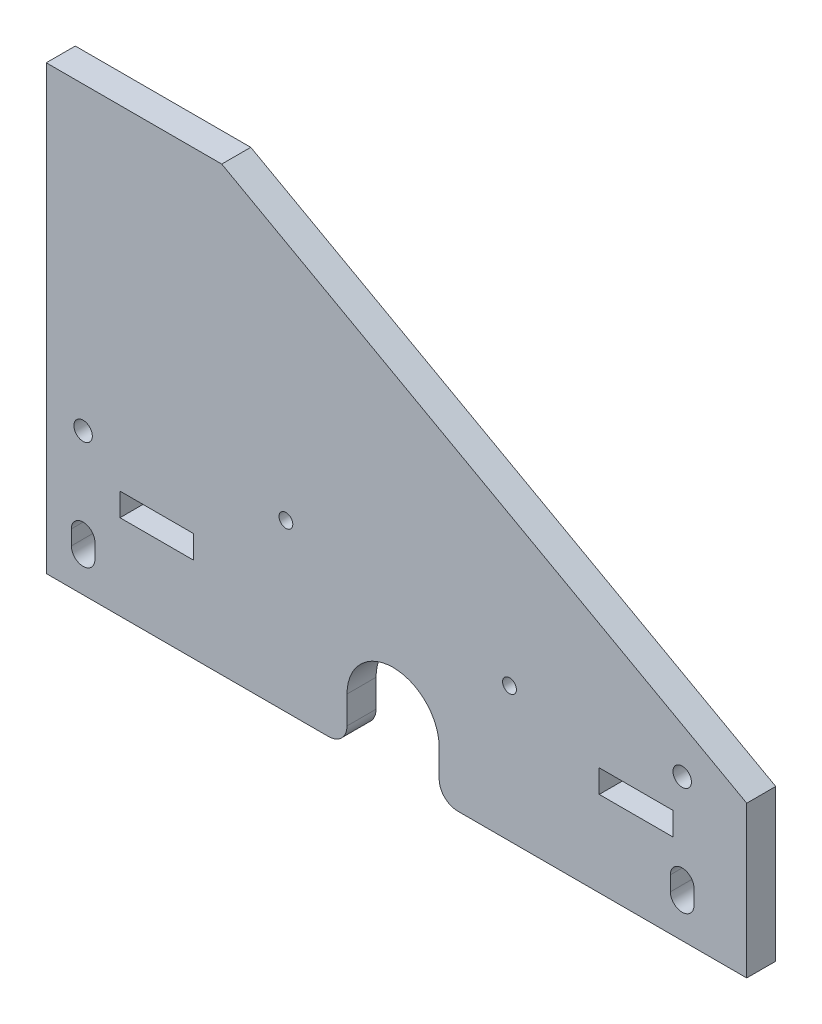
ISO-10303-21;
HEADER;
FILE_DESCRIPTION(('STEP AP214'),'2;1');
FILE_NAME('part.step','',(''),(''),'','','');
FILE_SCHEMA(('AUTOMOTIVE_DESIGN { 1 0 10303 214 1 1 1 1 }'));
ENDSEC;
DATA;
#1=APPLICATION_CONTEXT('core data for automotive mechanical design processes');
#2=APPLICATION_PROTOCOL_DEFINITION('international standard','automotive_design',2000,#1);
#3=PRODUCT_CONTEXT('',#1,'mechanical');
#4=PRODUCT('Part','Part','',(#3));
#5=PRODUCT_RELATED_PRODUCT_CATEGORY('part','',(#4));
#6=PRODUCT_DEFINITION_FORMATION('','',#4);
#7=PRODUCT_DEFINITION_CONTEXT('part definition',#1,'design');
#8=PRODUCT_DEFINITION('design','',#6,#7);
#9=PRODUCT_DEFINITION_SHAPE('','',#8);
#10=(LENGTH_UNIT() NAMED_UNIT(*) SI_UNIT(.MILLI.,.METRE.));
#11=(NAMED_UNIT(*) PLANE_ANGLE_UNIT() SI_UNIT($,.RADIAN.));
#12=(NAMED_UNIT(*) SI_UNIT($,.STERADIAN.) SOLID_ANGLE_UNIT());
#13=UNCERTAINTY_MEASURE_WITH_UNIT(LENGTH_MEASURE(1.E-05),#10,'distance_accuracy_value','');
#14=(GEOMETRIC_REPRESENTATION_CONTEXT(3) GLOBAL_UNCERTAINTY_ASSIGNED_CONTEXT((#13)) GLOBAL_UNIT_ASSIGNED_CONTEXT((#10,
#11,#12)) REPRESENTATION_CONTEXT('',''));
#15=CARTESIAN_POINT('',(0.,0.,0.));
#16=DIRECTION('',(0.,0.,1.));
#17=DIRECTION('',(1.,0.,0.));
#18=AXIS2_PLACEMENT_3D('',#15,#16,#17);
#19=CARTESIAN_POINT('',(-60.6694920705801,-18.231916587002,0.));
#20=DIRECTION('',(0.,0.,1.));
#21=DIRECTION('',(1.,0.,0.));
#22=AXIS2_PLACEMENT_3D('',#19,#20,#21);
#23=CYLINDRICAL_SURFACE('',#22,6.35);
#24=CARTESIAN_POINT('',(-60.6694920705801,-18.231916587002,10.));
#25=DIRECTION('',(0.,0.,1.));
#26=DIRECTION('',(1.,0.,0.));
#27=AXIS2_PLACEMENT_3D('',#24,#25,#26);
#28=CIRCLE('',#27,6.35);
#29=CARTESIAN_POINT('',(-67.0194920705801,-18.231916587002,10.));
#30=VERTEX_POINT('',#29);
#31=CARTESIAN_POINT('',(-60.6694920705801,-24.581916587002,10.));
#32=VERTEX_POINT('',#31);
#33=EDGE_CURVE('E364',#30,#32,#28,.T.);
#34=ORIENTED_EDGE('',*,*,#33,.F.);
#35=DIRECTION('',(0.,0.,1.));
#36=VECTOR('',#35,1.);
#37=CARTESIAN_POINT('',(-67.0194920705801,-18.231916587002,0.));
#38=LINE('',#37,#36);
#39=CARTESIAN_POINT('',(-67.0194920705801,-18.231916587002,0.));
#40=VERTEX_POINT('',#39);
#41=EDGE_CURVE('E11',#40,#30,#38,.T.);
#42=ORIENTED_EDGE('',*,*,#41,.F.);
#43=CARTESIAN_POINT('',(-60.6694920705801,-18.231916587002,0.));
#44=DIRECTION('',(0.,0.,1.));
#45=DIRECTION('',(1.,0.,0.));
#46=AXIS2_PLACEMENT_3D('',#43,#44,#45);
#47=CIRCLE('',#46,6.35);
#48=CARTESIAN_POINT('',(-60.6694920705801,-24.581916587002,0.));
#49=VERTEX_POINT('',#48);
#50=EDGE_CURVE('E367',#40,#49,#47,.T.);
#51=ORIENTED_EDGE('',*,*,#50,.T.);
#52=DIRECTION('',(0.,0.,1.));
#53=VECTOR('',#52,1.);
#54=CARTESIAN_POINT('',(-60.6694920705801,-24.581916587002,0.));
#55=LINE('',#54,#53);
#56=EDGE_CURVE('E34',#49,#32,#55,.T.);
#57=ORIENTED_EDGE('',*,*,#56,.T.);
#58=EDGE_LOOP('',(#34,#42,#51,#57));
#59=FACE_BOUND('',#58,.T.);
#60=ADVANCED_FACE('F31',(#59),#23,.T.);
#61=CARTESIAN_POINT('',(-67.0194920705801,-8.70691658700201,0.));
#62=DIRECTION('',(-1.,0.,0.));
#63=DIRECTION('',(0.,0.,1.));
#64=AXIS2_PLACEMENT_3D('',#61,#62,#63);
#65=PLANE('',#64);
#66=DIRECTION('',(0.,-1.,0.));
#67=VECTOR('',#66,1.);
#68=CARTESIAN_POINT('',(-67.0194920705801,-8.70691658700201,10.));
#69=LINE('',#68,#67);
#70=CARTESIAN_POINT('',(-67.0194920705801,-8.70691658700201,10.));
#71=VERTEX_POINT('',#70);
#72=EDGE_CURVE('E371',#71,#30,#69,.T.);
#73=ORIENTED_EDGE('',*,*,#72,.F.);
#74=DIRECTION('',(0.,0.,1.));
#75=VECTOR('',#74,1.);
#76=CARTESIAN_POINT('',(-67.0194920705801,-8.70691658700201,0.));
#77=LINE('',#76,#75);
#78=CARTESIAN_POINT('',(-67.0194920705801,-8.70691658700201,0.));
#79=VERTEX_POINT('',#78);
#80=EDGE_CURVE('E39',#79,#71,#77,.T.);
#81=ORIENTED_EDGE('',*,*,#80,.F.);
#82=DIRECTION('',(0.,-1.,0.));
#83=VECTOR('',#82,1.);
#84=CARTESIAN_POINT('',(-67.0194920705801,-8.70691658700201,0.));
#85=LINE('',#84,#83);
#86=EDGE_CURVE('E398',#79,#40,#85,.T.);
#87=ORIENTED_EDGE('',*,*,#86,.T.);
#88=ORIENTED_EDGE('',*,*,#41,.T.);
#89=EDGE_LOOP('',(#73,#81,#87,#88));
#90=FACE_BOUND('',#89,.T.);
#91=ADVANCED_FACE('F460',(#90),#65,.T.);
#92=CARTESIAN_POINT('',(-82.8944920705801,-8.70691658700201,0.));
#93=DIRECTION('',(0.,0.,1.));
#94=DIRECTION('',(1.,0.,0.));
#95=AXIS2_PLACEMENT_3D('',#92,#93,#94);
#96=CYLINDRICAL_SURFACE('',#95,15.875);
#97=CARTESIAN_POINT('',(-82.8944920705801,-8.70691658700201,10.));
#98=DIRECTION('',(0.,0.,-1.));
#99=DIRECTION('',(-1.,0.,0.));
#100=AXIS2_PLACEMENT_3D('',#97,#98,#99);
#101=CIRCLE('',#100,15.875);
#102=CARTESIAN_POINT('',(-98.7694920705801,-8.70691658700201,10.));
#103=VERTEX_POINT('',#102);
#104=EDGE_CURVE('E427',#103,#71,#101,.T.);
#105=ORIENTED_EDGE('',*,*,#104,.F.);
#106=DIRECTION('',(0.,0.,1.));
#107=VECTOR('',#106,1.);
#108=CARTESIAN_POINT('',(-98.7694920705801,-8.70691658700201,0.));
#109=LINE('',#108,#107);
#110=CARTESIAN_POINT('',(-98.7694920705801,-8.70691658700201,0.));
#111=VERTEX_POINT('',#110);
#112=EDGE_CURVE('E433',#111,#103,#109,.T.);
#113=ORIENTED_EDGE('',*,*,#112,.F.);
#114=CARTESIAN_POINT('',(-82.8944920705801,-8.70691658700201,0.));
#115=DIRECTION('',(0.,0.,-1.));
#116=DIRECTION('',(-1.,0.,0.));
#117=AXIS2_PLACEMENT_3D('',#114,#115,#116);
#118=CIRCLE('',#117,15.875);
#119=EDGE_CURVE('E395',#111,#79,#118,.T.);
#120=ORIENTED_EDGE('',*,*,#119,.T.);
#121=ORIENTED_EDGE('',*,*,#80,.T.);
#122=EDGE_LOOP('',(#105,#113,#120,#121));
#123=FACE_BOUND('',#122,.T.);
#124=ADVANCED_FACE('F492',(#123),#96,.F.);
#125=CARTESIAN_POINT('',(-98.7694920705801,-18.231916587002,0.));
#126=DIRECTION('',(1.,0.,0.));
#127=DIRECTION('',(0.,0.,-1.));
#128=AXIS2_PLACEMENT_3D('',#125,#126,#127);
#129=PLANE('',#128);
#130=DIRECTION('',(0.,1.,0.));
#131=VECTOR('',#130,1.);
#132=CARTESIAN_POINT('',(-98.7694920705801,-18.231916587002,10.));
#133=LINE('',#132,#131);
#134=CARTESIAN_POINT('',(-98.7694920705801,-18.231916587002,10.));
#135=VERTEX_POINT('',#134);
#136=EDGE_CURVE('E424',#135,#103,#133,.T.);
#137=ORIENTED_EDGE('',*,*,#136,.F.);
#138=DIRECTION('',(0.,0.,1.));
#139=VECTOR('',#138,1.);
#140=CARTESIAN_POINT('',(-98.7694920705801,-18.231916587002,0.));
#141=LINE('',#140,#139);
#142=CARTESIAN_POINT('',(-98.7694920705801,-18.231916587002,0.));
#143=VERTEX_POINT('',#142);
#144=EDGE_CURVE('E435',#143,#135,#141,.T.);
#145=ORIENTED_EDGE('',*,*,#144,.F.);
#146=DIRECTION('',(0.,1.,0.));
#147=VECTOR('',#146,1.);
#148=CARTESIAN_POINT('',(-98.7694920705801,-18.231916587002,0.));
#149=LINE('',#148,#147);
#150=EDGE_CURVE('E392',#143,#111,#149,.T.);
#151=ORIENTED_EDGE('',*,*,#150,.T.);
#152=ORIENTED_EDGE('',*,*,#112,.T.);
#153=EDGE_LOOP('',(#137,#145,#151,#152));
#154=FACE_BOUND('',#153,.T.);
#155=ADVANCED_FACE('F490',(#154),#129,.T.);
#156=CARTESIAN_POINT('',(-105.11949207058,-18.231916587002,0.));
#157=DIRECTION('',(0.,0.,1.));
#158=DIRECTION('',(1.,0.,0.));
#159=AXIS2_PLACEMENT_3D('',#156,#157,#158);
#160=CYLINDRICAL_SURFACE('',#159,6.34999999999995);
#161=CARTESIAN_POINT('',(-105.11949207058,-18.231916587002,10.));
#162=DIRECTION('',(0.,0.,1.));
#163=DIRECTION('',(1.,0.,0.));
#164=AXIS2_PLACEMENT_3D('',#161,#162,#163);
#165=CIRCLE('',#164,6.34999999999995);
#166=CARTESIAN_POINT('',(-105.11949207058,-24.5819165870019,10.));
#167=VERTEX_POINT('',#166);
#168=EDGE_CURVE('E421',#167,#135,#165,.T.);
#169=ORIENTED_EDGE('',*,*,#168,.F.);
#170=DIRECTION('',(0.,0.,1.));
#171=VECTOR('',#170,1.);
#172=CARTESIAN_POINT('',(-105.11949207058,-24.5819165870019,0.));
#173=LINE('',#172,#171);
#174=CARTESIAN_POINT('',(-105.11949207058,-24.5819165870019,0.));
#175=VERTEX_POINT('',#174);
#176=EDGE_CURVE('E437',#175,#167,#173,.T.);
#177=ORIENTED_EDGE('',*,*,#176,.F.);
#178=CARTESIAN_POINT('',(-105.11949207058,-18.231916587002,0.));
#179=DIRECTION('',(0.,0.,1.));
#180=DIRECTION('',(1.,0.,0.));
#181=AXIS2_PLACEMENT_3D('',#178,#179,#180);
#182=CIRCLE('',#181,6.34999999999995);
#183=EDGE_CURVE('E389',#175,#143,#182,.T.);
#184=ORIENTED_EDGE('',*,*,#183,.T.);
#185=ORIENTED_EDGE('',*,*,#144,.T.);
#186=EDGE_LOOP('',(#169,#177,#184,#185));
#187=FACE_BOUND('',#186,.T.);
#188=ADVANCED_FACE('F486',(#187),#160,.T.);
#189=CARTESIAN_POINT('',(-202.37863207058,-24.581916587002,0.));
#190=DIRECTION('',(0.,-1.,0.));
#191=DIRECTION('',(0.,0.,-1.));
#192=AXIS2_PLACEMENT_3D('',#189,#190,#191);
#193=PLANE('',#192);
#194=DIRECTION('',(1.,0.,0.));
#195=VECTOR('',#194,1.);
#196=CARTESIAN_POINT('',(-202.37863207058,-24.581916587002,10.));
#197=LINE('',#196,#195);
#198=CARTESIAN_POINT('',(-202.37863207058,-24.581916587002,10.));
#199=VERTEX_POINT('',#198);
#200=EDGE_CURVE('E418',#199,#167,#197,.T.);
#201=ORIENTED_EDGE('',*,*,#200,.F.);
#202=DIRECTION('',(0.,0.,1.));
#203=VECTOR('',#202,1.);
#204=CARTESIAN_POINT('',(-202.37863207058,-24.581916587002,0.));
#205=LINE('',#204,#203);
#206=CARTESIAN_POINT('',(-202.37863207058,-24.581916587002,0.));
#207=VERTEX_POINT('',#206);
#208=EDGE_CURVE('E439',#207,#199,#205,.T.);
#209=ORIENTED_EDGE('',*,*,#208,.F.);
#210=DIRECTION('',(1.,0.,0.));
#211=VECTOR('',#210,1.);
#212=CARTESIAN_POINT('',(-202.37863207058,-24.581916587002,0.));
#213=LINE('',#212,#211);
#214=EDGE_CURVE('E386',#207,#175,#213,.T.);
#215=ORIENTED_EDGE('',*,*,#214,.T.);
#216=ORIENTED_EDGE('',*,*,#176,.T.);
#217=EDGE_LOOP('',(#201,#209,#215,#216));
#218=FACE_BOUND('',#217,.T.);
#219=ADVANCED_FACE('F482',(#218),#193,.T.);
#220=CARTESIAN_POINT('',(-202.37863207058,127.818083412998,0.));
#221=DIRECTION('',(-1.,0.,0.));
#222=DIRECTION('',(0.,0.,1.));
#223=AXIS2_PLACEMENT_3D('',#220,#221,#222);
#224=PLANE('',#223);
#225=DIRECTION('',(0.,-1.,0.));
#226=VECTOR('',#225,1.);
#227=CARTESIAN_POINT('',(-202.37863207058,127.818083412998,10.));
#228=LINE('',#227,#226);
#229=CARTESIAN_POINT('',(-202.37863207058,127.818083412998,10.));
#230=VERTEX_POINT('',#229);
#231=EDGE_CURVE('E415',#230,#199,#228,.T.);
#232=ORIENTED_EDGE('',*,*,#231,.F.);
#233=DIRECTION('',(0.,0.,1.));
#234=VECTOR('',#233,1.);
#235=CARTESIAN_POINT('',(-202.37863207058,127.818083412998,0.));
#236=LINE('',#235,#234);
#237=CARTESIAN_POINT('',(-202.37863207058,127.818083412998,0.));
#238=VERTEX_POINT('',#237);
#239=EDGE_CURVE('E441',#238,#230,#236,.T.);
#240=ORIENTED_EDGE('',*,*,#239,.F.);
#241=DIRECTION('',(0.,-1.,0.));
#242=VECTOR('',#241,1.);
#243=CARTESIAN_POINT('',(-202.37863207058,127.818083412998,0.));
#244=LINE('',#243,#242);
#245=EDGE_CURVE('E383',#238,#207,#244,.T.);
#246=ORIENTED_EDGE('',*,*,#245,.T.);
#247=ORIENTED_EDGE('',*,*,#208,.T.);
#248=EDGE_LOOP('',(#232,#240,#246,#247));
#249=FACE_BOUND('',#248,.T.);
#250=ADVANCED_FACE('F478',(#249),#224,.T.);
#251=CARTESIAN_POINT('',(-141.92663207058,127.818083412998,0.));
#252=DIRECTION('',(0.,1.,0.));
#253=DIRECTION('',(0.,0.,1.));
#254=AXIS2_PLACEMENT_3D('',#251,#252,#253);
#255=PLANE('',#254);
#256=DIRECTION('',(-1.,0.,0.));
#257=VECTOR('',#256,1.);
#258=CARTESIAN_POINT('',(-141.92663207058,127.818083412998,10.));
#259=LINE('',#258,#257);
#260=CARTESIAN_POINT('',(-141.92663207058,127.818083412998,10.));
#261=VERTEX_POINT('',#260);
#262=EDGE_CURVE('E412',#261,#230,#259,.T.);
#263=ORIENTED_EDGE('',*,*,#262,.F.);
#264=DIRECTION('',(0.,0.,1.));
#265=VECTOR('',#264,1.);
#266=CARTESIAN_POINT('',(-141.92663207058,127.818083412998,0.));
#267=LINE('',#266,#265);
#268=CARTESIAN_POINT('',(-141.92663207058,127.818083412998,0.));
#269=VERTEX_POINT('',#268);
#270=EDGE_CURVE('E443',#269,#261,#267,.T.);
#271=ORIENTED_EDGE('',*,*,#270,.F.);
#272=DIRECTION('',(-1.,0.,0.));
#273=VECTOR('',#272,1.);
#274=CARTESIAN_POINT('',(-141.92663207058,127.818083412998,0.));
#275=LINE('',#274,#273);
#276=EDGE_CURVE('E380',#269,#238,#275,.T.);
#277=ORIENTED_EDGE('',*,*,#276,.T.);
#278=ORIENTED_EDGE('',*,*,#239,.T.);
#279=EDGE_LOOP('',(#263,#271,#277,#278));
#280=FACE_BOUND('',#279,.T.);
#281=ADVANCED_FACE('F474',(#280),#255,.T.);
#282=CARTESIAN_POINT('',(38.92136792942,27.5724000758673,0.));
#283=DIRECTION('',(0.484809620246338,0.874619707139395,0.));
#284=DIRECTION('',(-0.874619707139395,0.484809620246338,0.));
#285=AXIS2_PLACEMENT_3D('',#282,#283,#284);
#286=PLANE('',#285);
#287=DIRECTION('',(-0.874619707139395,0.484809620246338,0.));
#288=VECTOR('',#287,1.);
#289=CARTESIAN_POINT('',(38.92136792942,27.5724000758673,10.));
#290=LINE('',#289,#288);
#291=CARTESIAN_POINT('',(38.92136792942,27.5724000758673,10.));
#292=VERTEX_POINT('',#291);
#293=EDGE_CURVE('E409',#292,#261,#290,.T.);
#294=ORIENTED_EDGE('',*,*,#293,.F.);
#295=DIRECTION('',(0.,0.,1.));
#296=VECTOR('',#295,1.);
#297=CARTESIAN_POINT('',(38.92136792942,27.5724000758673,0.));
#298=LINE('',#297,#296);
#299=CARTESIAN_POINT('',(38.92136792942,27.5724000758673,0.));
#300=VERTEX_POINT('',#299);
#301=EDGE_CURVE('E445',#300,#292,#298,.T.);
#302=ORIENTED_EDGE('',*,*,#301,.F.);
#303=DIRECTION('',(-0.874619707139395,0.484809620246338,0.));
#304=VECTOR('',#303,1.);
#305=CARTESIAN_POINT('',(38.92136792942,27.5724000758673,0.));
#306=LINE('',#305,#304);
#307=EDGE_CURVE('E377',#300,#269,#306,.T.);
#308=ORIENTED_EDGE('',*,*,#307,.T.);
#309=ORIENTED_EDGE('',*,*,#270,.T.);
#310=EDGE_LOOP('',(#294,#302,#308,#309));
#311=FACE_BOUND('',#310,.T.);
#312=ADVANCED_FACE('F472',(#311),#286,.T.);
#313=CARTESIAN_POINT('',(38.92136792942,-24.581916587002,0.));
#314=DIRECTION('',(1.,0.,0.));
#315=DIRECTION('',(0.,0.,-1.));
#316=AXIS2_PLACEMENT_3D('',#313,#314,#315);
#317=PLANE('',#316);
#318=DIRECTION('',(0.,1.,0.));
#319=VECTOR('',#318,1.);
#320=CARTESIAN_POINT('',(38.92136792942,-24.581916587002,10.));
#321=LINE('',#320,#319);
#322=CARTESIAN_POINT('',(38.92136792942,-24.581916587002,10.));
#323=VERTEX_POINT('',#322);
#324=EDGE_CURVE('E406',#323,#292,#321,.T.);
#325=ORIENTED_EDGE('',*,*,#324,.F.);
#326=DIRECTION('',(0.,0.,1.));
#327=VECTOR('',#326,1.);
#328=CARTESIAN_POINT('',(38.92136792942,-24.581916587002,0.));
#329=LINE('',#328,#327);
#330=CARTESIAN_POINT('',(38.92136792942,-24.581916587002,0.));
#331=VERTEX_POINT('',#330);
#332=EDGE_CURVE('E446',#331,#323,#329,.T.);
#333=ORIENTED_EDGE('',*,*,#332,.F.);
#334=DIRECTION('',(0.,1.,0.));
#335=VECTOR('',#334,1.);
#336=CARTESIAN_POINT('',(38.92136792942,-24.581916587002,0.));
#337=LINE('',#336,#335);
#338=EDGE_CURVE('E374',#331,#300,#337,.T.);
#339=ORIENTED_EDGE('',*,*,#338,.T.);
#340=ORIENTED_EDGE('',*,*,#301,.T.);
#341=EDGE_LOOP('',(#325,#333,#339,#340));
#342=FACE_BOUND('',#341,.T.);
#343=ADVANCED_FACE('F468',(#342),#317,.T.);
#344=CARTESIAN_POINT('',(-60.6694920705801,-24.581916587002,0.));
#345=DIRECTION('',(0.,-1.,0.));
#346=DIRECTION('',(0.,0.,-1.));
#347=AXIS2_PLACEMENT_3D('',#344,#345,#346);
#348=PLANE('',#347);
#349=DIRECTION('',(1.,0.,0.));
#350=VECTOR('',#349,1.);
#351=CARTESIAN_POINT('',(-60.6694920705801,-24.581916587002,10.));
#352=LINE('',#351,#350);
#353=EDGE_CURVE('E403',#32,#323,#352,.T.);
#354=ORIENTED_EDGE('',*,*,#353,.F.);
#355=ORIENTED_EDGE('',*,*,#56,.F.);
#356=DIRECTION('',(1.,0.,0.));
#357=VECTOR('',#356,1.);
#358=CARTESIAN_POINT('',(-60.6694920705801,-24.581916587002,0.));
#359=LINE('',#358,#357);
#360=EDGE_CURVE('E370',#49,#331,#359,.T.);
#361=ORIENTED_EDGE('',*,*,#360,.T.);
#362=ORIENTED_EDGE('',*,*,#332,.T.);
#363=EDGE_LOOP('',(#354,#355,#361,#362));
#364=FACE_BOUND('',#363,.T.);
#365=ADVANCED_FACE('F454',(#364),#348,.T.);
#366=CARTESIAN_POINT('',(-60.6694920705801,-18.231916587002,0.));
#367=DIRECTION('',(0.,0.,1.));
#368=DIRECTION('',(1.,0.,0.));
#369=AXIS2_PLACEMENT_3D('',#366,#367,#368);
#370=PLANE('',#369);
#371=DIRECTION('',(0.,-1.,0.));
#372=VECTOR('',#371,1.);
#373=CARTESIAN_POINT('',(-176.97863207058,4.78810341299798,0.));
#374=LINE('',#373,#372);
#375=CARTESIAN_POINT('',(-176.97863207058,12.725603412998,0.));
#376=VERTEX_POINT('',#375);
#377=CARTESIAN_POINT('',(-176.97863207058,4.78810341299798,0.));
#378=VERTEX_POINT('',#377);
#379=EDGE_CURVE('E218',#376,#378,#374,.T.);
#380=ORIENTED_EDGE('',*,*,#379,.T.);
#381=DIRECTION('',(1.,0.,0.));
#382=VECTOR('',#381,1.);
#383=CARTESIAN_POINT('',(-151.57863207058,4.78810341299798,0.));
#384=LINE('',#383,#382);
#385=CARTESIAN_POINT('',(-151.57863207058,4.78810341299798,0.));
#386=VERTEX_POINT('',#385);
#387=EDGE_CURVE('E212',#378,#386,#384,.T.);
#388=ORIENTED_EDGE('',*,*,#387,.T.);
#389=DIRECTION('',(0.,1.,0.));
#390=VECTOR('',#389,1.);
#391=CARTESIAN_POINT('',(-151.57863207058,12.725603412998,0.));
#392=LINE('',#391,#390);
#393=CARTESIAN_POINT('',(-151.57863207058,12.725603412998,0.));
#394=VERTEX_POINT('',#393);
#395=EDGE_CURVE('E221',#386,#394,#392,.T.);
#396=ORIENTED_EDGE('',*,*,#395,.T.);
#397=DIRECTION('',(-1.,0.,0.));
#398=VECTOR('',#397,1.);
#399=CARTESIAN_POINT('',(-176.97863207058,12.725603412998,0.));
#400=LINE('',#399,#398);
#401=EDGE_CURVE('E47',#394,#376,#400,.T.);
#402=ORIENTED_EDGE('',*,*,#401,.T.);
#403=EDGE_LOOP('',(#380,#388,#396,#402));
#404=FACE_BOUND('',#403,.T.);
#405=DIRECTION('',(0.,-1.,0.));
#406=VECTOR('',#405,1.);
#407=CARTESIAN_POINT('',(-193.74263207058,-12.008916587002,0.));
#408=LINE('',#407,#406);
#409=CARTESIAN_POINT('',(-193.74263207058,-6.92891658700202,0.));
#410=VERTEX_POINT('',#409);
#411=CARTESIAN_POINT('',(-193.74263207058,-12.008916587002,0.));
#412=VERTEX_POINT('',#411);
#413=EDGE_CURVE('E257',#410,#412,#408,.T.);
#414=ORIENTED_EDGE('',*,*,#413,.T.);
#415=CARTESIAN_POINT('',(-189.67863207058,-12.008916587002,0.));
#416=DIRECTION('',(0.,0.,1.));
#417=DIRECTION('',(-1.,0.,0.));
#418=AXIS2_PLACEMENT_3D('',#415,#416,#417);
#419=CIRCLE('',#418,4.064);
#420=CARTESIAN_POINT('',(-185.61463207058,-12.008916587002,0.));
#421=VERTEX_POINT('',#420);
#422=EDGE_CURVE('E247',#412,#421,#419,.T.);
#423=ORIENTED_EDGE('',*,*,#422,.T.);
#424=DIRECTION('',(0.,1.,0.));
#425=VECTOR('',#424,1.);
#426=CARTESIAN_POINT('',(-185.61463207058,-6.92891658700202,0.));
#427=LINE('',#426,#425);
#428=CARTESIAN_POINT('',(-185.61463207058,-6.92891658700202,0.));
#429=VERTEX_POINT('',#428);
#430=EDGE_CURVE('E250',#421,#429,#427,.T.);
#431=ORIENTED_EDGE('',*,*,#430,.T.);
#432=CARTESIAN_POINT('',(-189.67863207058,-6.92891658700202,0.));
#433=DIRECTION('',(0.,0.,1.));
#434=DIRECTION('',(-1.,0.,0.));
#435=AXIS2_PLACEMENT_3D('',#432,#433,#434);
#436=CIRCLE('',#435,4.064);
#437=EDGE_CURVE('E254',#429,#410,#436,.T.);
#438=ORIENTED_EDGE('',*,*,#437,.T.);
#439=EDGE_LOOP('',(#414,#423,#431,#438));
#440=FACE_BOUND('',#439,.T.);
#441=CARTESIAN_POINT('',(-189.67863207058,24.358803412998,0.));
#442=DIRECTION('',(0.,0.,1.));
#443=DIRECTION('',(-1.,0.,0.));
#444=AXIS2_PLACEMENT_3D('',#441,#442,#443);
#445=CIRCLE('',#444,3.17500000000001);
#446=CARTESIAN_POINT('',(-192.85363207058,24.358803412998,0.));
#447=VERTEX_POINT('',#446);
#448=EDGE_CURVE('E279',#447,#447,#445,.T.);
#449=ORIENTED_EDGE('',*,*,#448,.T.);
#450=EDGE_LOOP('',(#449));
#451=FACE_BOUND('',#450,.T.);
#452=CARTESIAN_POINT('',(-119.82863207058,32.568083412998,0.));
#453=DIRECTION('',(0.,0.,1.));
#454=DIRECTION('',(-1.,0.,0.));
#455=AXIS2_PLACEMENT_3D('',#452,#453,#454);
#456=CIRCLE('',#455,2.38125);
#457=CARTESIAN_POINT('',(-122.20988207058,32.568083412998,0.));
#458=VERTEX_POINT('',#457);
#459=EDGE_CURVE('E285',#458,#458,#456,.T.);
#460=ORIENTED_EDGE('',*,*,#459,.T.);
#461=EDGE_LOOP('',(#460));
#462=FACE_BOUND('',#461,.T.);
#463=CARTESIAN_POINT('',(-42.7929720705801,21.773083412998,0.));
#464=DIRECTION('',(0.,0.,1.));
#465=DIRECTION('',(-1.,0.,0.));
#466=AXIS2_PLACEMENT_3D('',#463,#464,#465);
#467=CIRCLE('',#466,2.38125);
#468=CARTESIAN_POINT('',(-45.1742220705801,21.773083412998,0.));
#469=VERTEX_POINT('',#468);
#470=EDGE_CURVE('E291',#469,#469,#467,.T.);
#471=ORIENTED_EDGE('',*,*,#470,.T.);
#472=EDGE_LOOP('',(#471));
#473=FACE_BOUND('',#472,.T.);
#474=DIRECTION('',(0.,1.,0.));
#475=VECTOR('',#474,1.);
#476=CARTESIAN_POINT('',(13.5213679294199,12.725603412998,0.));
#477=LINE('',#476,#475);
#478=CARTESIAN_POINT('',(13.5213679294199,4.78810341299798,0.));
#479=VERTEX_POINT('',#478);
#480=CARTESIAN_POINT('',(13.5213679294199,12.725603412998,0.));
#481=VERTEX_POINT('',#480);
#482=EDGE_CURVE('E307',#479,#481,#477,.T.);
#483=ORIENTED_EDGE('',*,*,#482,.T.);
#484=DIRECTION('',(-1.,0.,0.));
#485=VECTOR('',#484,1.);
#486=CARTESIAN_POINT('',(-11.87863207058,12.725603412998,0.));
#487=LINE('',#486,#485);
#488=CARTESIAN_POINT('',(-11.87863207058,12.725603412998,0.));
#489=VERTEX_POINT('',#488);
#490=EDGE_CURVE('E297',#481,#489,#487,.T.);
#491=ORIENTED_EDGE('',*,*,#490,.T.);
#492=DIRECTION('',(0.,-1.,0.));
#493=VECTOR('',#492,1.);
#494=CARTESIAN_POINT('',(-11.87863207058,4.78810341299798,0.));
#495=LINE('',#494,#493);
#496=CARTESIAN_POINT('',(-11.87863207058,4.78810341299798,0.));
#497=VERTEX_POINT('',#496);
#498=EDGE_CURVE('E300',#489,#497,#495,.T.);
#499=ORIENTED_EDGE('',*,*,#498,.T.);
#500=DIRECTION('',(1.,0.,0.));
#501=VECTOR('',#500,1.);
#502=CARTESIAN_POINT('',(13.5213679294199,4.78810341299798,0.));
#503=LINE('',#502,#501);
#504=EDGE_CURVE('E304',#497,#479,#503,.T.);
#505=ORIENTED_EDGE('',*,*,#504,.T.);
#506=EDGE_LOOP('',(#483,#491,#499,#505));
#507=FACE_BOUND('',#506,.T.);
#508=DIRECTION('',(0.,-1.,0.));
#509=VECTOR('',#508,1.);
#510=CARTESIAN_POINT('',(12.6323679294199,-12.008916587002,0.));
#511=LINE('',#510,#509);
#512=CARTESIAN_POINT('',(12.6323679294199,-6.92891658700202,0.));
#513=VERTEX_POINT('',#512);
#514=CARTESIAN_POINT('',(12.6323679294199,-12.008916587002,0.));
#515=VERTEX_POINT('',#514);
#516=EDGE_CURVE('E339',#513,#515,#511,.T.);
#517=ORIENTED_EDGE('',*,*,#516,.T.);
#518=CARTESIAN_POINT('',(16.6963679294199,-12.008916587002,0.));
#519=DIRECTION('',(0.,0.,1.));
#520=DIRECTION('',(-1.,0.,0.));
#521=AXIS2_PLACEMENT_3D('',#518,#519,#520);
#522=CIRCLE('',#521,4.06400000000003);
#523=CARTESIAN_POINT('',(20.76036792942,-12.008916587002,0.));
#524=VERTEX_POINT('',#523);
#525=EDGE_CURVE('E329',#515,#524,#522,.T.);
#526=ORIENTED_EDGE('',*,*,#525,.T.);
#527=DIRECTION('',(0.,1.,0.));
#528=VECTOR('',#527,1.);
#529=CARTESIAN_POINT('',(20.76036792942,-6.92891658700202,0.));
#530=LINE('',#529,#528);
#531=CARTESIAN_POINT('',(20.76036792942,-6.92891658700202,0.));
#532=VERTEX_POINT('',#531);
#533=EDGE_CURVE('E332',#524,#532,#530,.T.);
#534=ORIENTED_EDGE('',*,*,#533,.T.);
#535=CARTESIAN_POINT('',(16.6963679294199,-6.92891658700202,0.));
#536=DIRECTION('',(0.,0.,1.));
#537=DIRECTION('',(-1.,0.,0.));
#538=AXIS2_PLACEMENT_3D('',#535,#536,#537);
#539=CIRCLE('',#538,4.06400000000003);
#540=EDGE_CURVE('E336',#532,#513,#539,.T.);
#541=ORIENTED_EDGE('',*,*,#540,.T.);
#542=EDGE_LOOP('',(#517,#526,#534,#541));
#543=FACE_BOUND('',#542,.T.);
#544=CARTESIAN_POINT('',(16.6963679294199,24.358803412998,0.));
#545=DIRECTION('',(0.,0.,1.));
#546=DIRECTION('',(-1.,0.,0.));
#547=AXIS2_PLACEMENT_3D('',#544,#545,#546);
#548=CIRCLE('',#547,3.175);
#549=CARTESIAN_POINT('',(13.5213679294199,24.358803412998,0.));
#550=VERTEX_POINT('',#549);
#551=EDGE_CURVE('E361',#550,#550,#548,.T.);
#552=ORIENTED_EDGE('',*,*,#551,.T.);
#553=EDGE_LOOP('',(#552));
#554=FACE_BOUND('',#553,.T.);
#555=ORIENTED_EDGE('',*,*,#50,.F.);
#556=ORIENTED_EDGE('',*,*,#86,.F.);
#557=ORIENTED_EDGE('',*,*,#119,.F.);
#558=ORIENTED_EDGE('',*,*,#150,.F.);
#559=ORIENTED_EDGE('',*,*,#183,.F.);
#560=ORIENTED_EDGE('',*,*,#214,.F.);
#561=ORIENTED_EDGE('',*,*,#245,.F.);
#562=ORIENTED_EDGE('',*,*,#276,.F.);
#563=ORIENTED_EDGE('',*,*,#307,.F.);
#564=ORIENTED_EDGE('',*,*,#338,.F.);
#565=ORIENTED_EDGE('',*,*,#360,.F.);
#566=EDGE_LOOP('',(#555,#556,#557,#558,#559,#560,#561,#562,#563,#564,#565));
#567=FACE_BOUND('',#566,.T.);
#568=ADVANCED_FACE('F225',(#404,#440,#451,#462,#473,#507,#543,#554,#567),#370,.F.);
#569=CARTESIAN_POINT('',(-60.6694920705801,-18.231916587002,10.));
#570=DIRECTION('',(0.,0.,1.));
#571=DIRECTION('',(1.,0.,0.));
#572=AXIS2_PLACEMENT_3D('',#569,#570,#571);
#573=PLANE('',#572);
#574=DIRECTION('',(1.,0.,0.));
#575=VECTOR('',#574,1.);
#576=CARTESIAN_POINT('',(-151.57863207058,4.78810341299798,10.));
#577=LINE('',#576,#575);
#578=CARTESIAN_POINT('',(-176.97863207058,4.78810341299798,10.));
#579=VERTEX_POINT('',#578);
#580=CARTESIAN_POINT('',(-151.57863207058,4.78810341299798,10.));
#581=VERTEX_POINT('',#580);
#582=EDGE_CURVE('E55',#579,#581,#577,.T.);
#583=ORIENTED_EDGE('',*,*,#582,.F.);
#584=DIRECTION('',(0.,-1.,0.));
#585=VECTOR('',#584,1.);
#586=CARTESIAN_POINT('',(-176.97863207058,4.78810341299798,10.));
#587=LINE('',#586,#585);
#588=CARTESIAN_POINT('',(-176.97863207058,12.725603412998,10.));
#589=VERTEX_POINT('',#588);
#590=EDGE_CURVE('E228',#589,#579,#587,.T.);
#591=ORIENTED_EDGE('',*,*,#590,.F.);
#592=DIRECTION('',(-1.,0.,0.));
#593=VECTOR('',#592,1.);
#594=CARTESIAN_POINT('',(-176.97863207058,12.725603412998,10.));
#595=LINE('',#594,#593);
#596=CARTESIAN_POINT('',(-151.57863207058,12.725603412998,10.));
#597=VERTEX_POINT('',#596);
#598=EDGE_CURVE('E231',#597,#589,#595,.T.);
#599=ORIENTED_EDGE('',*,*,#598,.F.);
#600=DIRECTION('',(0.,1.,0.));
#601=VECTOR('',#600,1.);
#602=CARTESIAN_POINT('',(-151.57863207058,12.725603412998,10.));
#603=LINE('',#602,#601);
#604=EDGE_CURVE('E237',#581,#597,#603,.T.);
#605=ORIENTED_EDGE('',*,*,#604,.F.);
#606=EDGE_LOOP('',(#583,#591,#599,#605));
#607=FACE_BOUND('',#606,.T.);
#608=CARTESIAN_POINT('',(-189.67863207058,-12.008916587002,10.));
#609=DIRECTION('',(0.,0.,1.));
#610=DIRECTION('',(-1.,0.,0.));
#611=AXIS2_PLACEMENT_3D('',#608,#609,#610);
#612=CIRCLE('',#611,4.064);
#613=CARTESIAN_POINT('',(-193.74263207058,-12.008916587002,10.));
#614=VERTEX_POINT('',#613);
#615=CARTESIAN_POINT('',(-185.61463207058,-12.008916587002,10.));
#616=VERTEX_POINT('',#615);
#617=EDGE_CURVE('E243',#614,#616,#612,.T.);
#618=ORIENTED_EDGE('',*,*,#617,.F.);
#619=DIRECTION('',(0.,-1.,0.));
#620=VECTOR('',#619,1.);
#621=CARTESIAN_POINT('',(-193.74263207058,-12.008916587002,10.));
#622=LINE('',#621,#620);
#623=CARTESIAN_POINT('',(-193.74263207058,-6.92891658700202,10.));
#624=VERTEX_POINT('',#623);
#625=EDGE_CURVE('E251',#624,#614,#622,.T.);
#626=ORIENTED_EDGE('',*,*,#625,.F.);
#627=CARTESIAN_POINT('',(-189.67863207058,-6.92891658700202,10.));
#628=DIRECTION('',(0.,0.,1.));
#629=DIRECTION('',(-1.,0.,0.));
#630=AXIS2_PLACEMENT_3D('',#627,#628,#629);
#631=CIRCLE('',#630,4.064);
#632=CARTESIAN_POINT('',(-185.61463207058,-6.92891658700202,10.));
#633=VERTEX_POINT('',#632);
#634=EDGE_CURVE('E265',#633,#624,#631,.T.);
#635=ORIENTED_EDGE('',*,*,#634,.F.);
#636=DIRECTION('',(0.,1.,0.));
#637=VECTOR('',#636,1.);
#638=CARTESIAN_POINT('',(-185.61463207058,-6.92891658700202,10.));
#639=LINE('',#638,#637);
#640=EDGE_CURVE('E262',#616,#633,#639,.T.);
#641=ORIENTED_EDGE('',*,*,#640,.F.);
#642=EDGE_LOOP('',(#618,#626,#635,#641));
#643=FACE_BOUND('',#642,.T.);
#644=CARTESIAN_POINT('',(-189.67863207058,24.358803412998,10.));
#645=DIRECTION('',(0.,0.,1.));
#646=DIRECTION('',(-1.,0.,0.));
#647=AXIS2_PLACEMENT_3D('',#644,#645,#646);
#648=CIRCLE('',#647,3.17500000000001);
#649=CARTESIAN_POINT('',(-192.85363207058,24.358803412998,10.));
#650=VERTEX_POINT('',#649);
#651=EDGE_CURVE('E272',#650,#650,#648,.T.);
#652=ORIENTED_EDGE('',*,*,#651,.F.);
#653=EDGE_LOOP('',(#652));
#654=FACE_BOUND('',#653,.T.);
#655=CARTESIAN_POINT('',(-119.82863207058,32.568083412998,10.));
#656=DIRECTION('',(0.,0.,1.));
#657=DIRECTION('',(-1.,0.,0.));
#658=AXIS2_PLACEMENT_3D('',#655,#656,#657);
#659=CIRCLE('',#658,2.38125);
#660=CARTESIAN_POINT('',(-122.20988207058,32.568083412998,10.));
#661=VERTEX_POINT('',#660);
#662=EDGE_CURVE('E282',#661,#661,#659,.T.);
#663=ORIENTED_EDGE('',*,*,#662,.F.);
#664=EDGE_LOOP('',(#663));
#665=FACE_BOUND('',#664,.T.);
#666=CARTESIAN_POINT('',(-42.7929720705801,21.773083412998,10.));
#667=DIRECTION('',(0.,0.,1.));
#668=DIRECTION('',(-1.,0.,0.));
#669=AXIS2_PLACEMENT_3D('',#666,#667,#668);
#670=CIRCLE('',#669,2.38125);
#671=CARTESIAN_POINT('',(-45.1742220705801,21.773083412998,10.));
#672=VERTEX_POINT('',#671);
#673=EDGE_CURVE('E288',#672,#672,#670,.T.);
#674=ORIENTED_EDGE('',*,*,#673,.F.);
#675=EDGE_LOOP('',(#674));
#676=FACE_BOUND('',#675,.T.);
#677=DIRECTION('',(-1.,0.,0.));
#678=VECTOR('',#677,1.);
#679=CARTESIAN_POINT('',(-11.87863207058,12.725603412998,10.));
#680=LINE('',#679,#678);
#681=CARTESIAN_POINT('',(13.5213679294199,12.725603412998,10.));
#682=VERTEX_POINT('',#681);
#683=CARTESIAN_POINT('',(-11.87863207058,12.725603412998,10.));
#684=VERTEX_POINT('',#683);
#685=EDGE_CURVE('E294',#682,#684,#680,.T.);
#686=ORIENTED_EDGE('',*,*,#685,.F.);
#687=DIRECTION('',(0.,1.,0.));
#688=VECTOR('',#687,1.);
#689=CARTESIAN_POINT('',(13.5213679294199,12.725603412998,10.));
#690=LINE('',#689,#688);
#691=CARTESIAN_POINT('',(13.5213679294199,4.78810341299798,10.));
#692=VERTEX_POINT('',#691);
#693=EDGE_CURVE('E301',#692,#682,#690,.T.);
#694=ORIENTED_EDGE('',*,*,#693,.F.);
#695=DIRECTION('',(1.,0.,0.));
#696=VECTOR('',#695,1.);
#697=CARTESIAN_POINT('',(13.5213679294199,4.78810341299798,10.));
#698=LINE('',#697,#696);
#699=CARTESIAN_POINT('',(-11.87863207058,4.78810341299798,10.));
#700=VERTEX_POINT('',#699);
#701=EDGE_CURVE('E315',#700,#692,#698,.T.);
#702=ORIENTED_EDGE('',*,*,#701,.F.);
#703=DIRECTION('',(0.,-1.,0.));
#704=VECTOR('',#703,1.);
#705=CARTESIAN_POINT('',(-11.87863207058,4.78810341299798,10.));
#706=LINE('',#705,#704);
#707=EDGE_CURVE('E312',#684,#700,#706,.T.);
#708=ORIENTED_EDGE('',*,*,#707,.F.);
#709=EDGE_LOOP('',(#686,#694,#702,#708));
#710=FACE_BOUND('',#709,.T.);
#711=CARTESIAN_POINT('',(16.6963679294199,-12.008916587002,10.));
#712=DIRECTION('',(0.,0.,1.));
#713=DIRECTION('',(-1.,0.,0.));
#714=AXIS2_PLACEMENT_3D('',#711,#712,#713);
#715=CIRCLE('',#714,4.06400000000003);
#716=CARTESIAN_POINT('',(12.6323679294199,-12.008916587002,10.));
#717=VERTEX_POINT('',#716);
#718=CARTESIAN_POINT('',(20.76036792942,-12.008916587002,10.));
#719=VERTEX_POINT('',#718);
#720=EDGE_CURVE('E322',#717,#719,#715,.T.);
#721=ORIENTED_EDGE('',*,*,#720,.F.);
#722=DIRECTION('',(0.,-1.,0.));
#723=VECTOR('',#722,1.);
#724=CARTESIAN_POINT('',(12.6323679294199,-12.008916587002,10.));
#725=LINE('',#724,#723);
#726=CARTESIAN_POINT('',(12.6323679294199,-6.92891658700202,10.));
#727=VERTEX_POINT('',#726);
#728=EDGE_CURVE('E333',#727,#717,#725,.T.);
#729=ORIENTED_EDGE('',*,*,#728,.F.);
#730=CARTESIAN_POINT('',(16.6963679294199,-6.92891658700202,10.));
#731=DIRECTION('',(0.,0.,1.));
#732=DIRECTION('',(-1.,0.,0.));
#733=AXIS2_PLACEMENT_3D('',#730,#731,#732);
#734=CIRCLE('',#733,4.06400000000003);
#735=CARTESIAN_POINT('',(20.76036792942,-6.92891658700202,10.));
#736=VERTEX_POINT('',#735);
#737=EDGE_CURVE('E347',#736,#727,#734,.T.);
#738=ORIENTED_EDGE('',*,*,#737,.F.);
#739=DIRECTION('',(0.,1.,0.));
#740=VECTOR('',#739,1.);
#741=CARTESIAN_POINT('',(20.76036792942,-6.92891658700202,10.));
#742=LINE('',#741,#740);
#743=EDGE_CURVE('E344',#719,#736,#742,.T.);
#744=ORIENTED_EDGE('',*,*,#743,.F.);
#745=EDGE_LOOP('',(#721,#729,#738,#744));
#746=FACE_BOUND('',#745,.T.);
#747=CARTESIAN_POINT('',(16.6963679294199,24.358803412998,10.));
#748=DIRECTION('',(0.,0.,1.));
#749=DIRECTION('',(-1.,0.,0.));
#750=AXIS2_PLACEMENT_3D('',#747,#748,#749);
#751=CIRCLE('',#750,3.175);
#752=CARTESIAN_POINT('',(13.5213679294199,24.358803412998,10.));
#753=VERTEX_POINT('',#752);
#754=EDGE_CURVE('E354',#753,#753,#751,.T.);
#755=ORIENTED_EDGE('',*,*,#754,.F.);
#756=EDGE_LOOP('',(#755));
#757=FACE_BOUND('',#756,.T.);
#758=ORIENTED_EDGE('',*,*,#33,.T.);
#759=ORIENTED_EDGE('',*,*,#353,.T.);
#760=ORIENTED_EDGE('',*,*,#324,.T.);
#761=ORIENTED_EDGE('',*,*,#293,.T.);
#762=ORIENTED_EDGE('',*,*,#262,.T.);
#763=ORIENTED_EDGE('',*,*,#231,.T.);
#764=ORIENTED_EDGE('',*,*,#200,.T.);
#765=ORIENTED_EDGE('',*,*,#168,.T.);
#766=ORIENTED_EDGE('',*,*,#136,.T.);
#767=ORIENTED_EDGE('',*,*,#104,.T.);
#768=ORIENTED_EDGE('',*,*,#72,.T.);
#769=EDGE_LOOP('',(#758,#759,#760,#761,#762,#763,#764,#765,#766,#767,#768));
#770=FACE_BOUND('',#769,.T.);
#771=ADVANCED_FACE('F456',(#607,#643,#654,#665,#676,#710,#746,#757,#770),#573,.T.);
#772=CARTESIAN_POINT('',(16.6963679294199,24.358803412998,0.));
#773=DIRECTION('',(0.,0.,1.));
#774=DIRECTION('',(1.,0.,0.));
#775=AXIS2_PLACEMENT_3D('',#772,#773,#774);
#776=CYLINDRICAL_SURFACE('',#775,3.175);
#777=ORIENTED_EDGE('',*,*,#551,.F.);
#778=EDGE_LOOP('',(#777));
#779=FACE_BOUND('',#778,.T.);
#780=ORIENTED_EDGE('',*,*,#754,.T.);
#781=EDGE_LOOP('',(#780));
#782=FACE_BOUND('',#781,.T.);
#783=ADVANCED_FACE('F590',(#779,#782),#776,.F.);
#784=CARTESIAN_POINT('',(16.6963679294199,-12.008916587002,0.));
#785=DIRECTION('',(0.,0.,1.));
#786=DIRECTION('',(1.,0.,0.));
#787=AXIS2_PLACEMENT_3D('',#784,#785,#786);
#788=CYLINDRICAL_SURFACE('',#787,4.06400000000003);
#789=ORIENTED_EDGE('',*,*,#720,.T.);
#790=DIRECTION('',(0.,0.,1.));
#791=VECTOR('',#790,1.);
#792=CARTESIAN_POINT('',(20.76036792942,-12.008916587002,0.));
#793=LINE('',#792,#791);
#794=EDGE_CURVE('E342',#524,#719,#793,.T.);
#795=ORIENTED_EDGE('',*,*,#794,.F.);
#796=ORIENTED_EDGE('',*,*,#525,.F.);
#797=DIRECTION('',(0.,0.,1.));
#798=VECTOR('',#797,1.);
#799=CARTESIAN_POINT('',(12.6323679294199,-12.008916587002,0.));
#800=LINE('',#799,#798);
#801=EDGE_CURVE('E352',#515,#717,#800,.T.);
#802=ORIENTED_EDGE('',*,*,#801,.T.);
#803=EDGE_LOOP('',(#789,#795,#796,#802));
#804=FACE_BOUND('',#803,.T.);
#805=ADVANCED_FACE('F600',(#804),#788,.F.);
#806=CARTESIAN_POINT('',(12.6323679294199,-12.008916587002,0.));
#807=DIRECTION('',(-1.,0.,0.));
#808=DIRECTION('',(0.,-1.,0.));
#809=AXIS2_PLACEMENT_3D('',#806,#807,#808);
#810=PLANE('',#809);
#811=ORIENTED_EDGE('',*,*,#728,.T.);
#812=ORIENTED_EDGE('',*,*,#801,.F.);
#813=ORIENTED_EDGE('',*,*,#516,.F.);
#814=DIRECTION('',(0.,0.,1.));
#815=VECTOR('',#814,1.);
#816=CARTESIAN_POINT('',(12.6323679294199,-6.92891658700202,0.));
#817=LINE('',#816,#815);
#818=EDGE_CURVE('E355',#513,#727,#817,.T.);
#819=ORIENTED_EDGE('',*,*,#818,.T.);
#820=EDGE_LOOP('',(#811,#812,#813,#819));
#821=FACE_BOUND('',#820,.T.);
#822=ADVANCED_FACE('F610',(#821),#810,.F.);
#823=CARTESIAN_POINT('',(16.6963679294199,-6.92891658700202,0.));
#824=DIRECTION('',(0.,0.,1.));
#825=DIRECTION('',(1.,0.,0.));
#826=AXIS2_PLACEMENT_3D('',#823,#824,#825);
#827=CYLINDRICAL_SURFACE('',#826,4.06400000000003);
#828=ORIENTED_EDGE('',*,*,#737,.T.);
#829=ORIENTED_EDGE('',*,*,#818,.F.);
#830=ORIENTED_EDGE('',*,*,#540,.F.);
#831=DIRECTION('',(0.,0.,1.));
#832=VECTOR('',#831,1.);
#833=CARTESIAN_POINT('',(20.76036792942,-6.92891658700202,0.));
#834=LINE('',#833,#832);
#835=EDGE_CURVE('E357',#532,#736,#834,.T.);
#836=ORIENTED_EDGE('',*,*,#835,.T.);
#837=EDGE_LOOP('',(#828,#829,#830,#836));
#838=FACE_BOUND('',#837,.T.);
#839=ADVANCED_FACE('F620',(#838),#827,.F.);
#840=CARTESIAN_POINT('',(20.76036792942,-6.92891658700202,0.));
#841=DIRECTION('',(1.,0.,0.));
#842=DIRECTION('',(0.,1.,0.));
#843=AXIS2_PLACEMENT_3D('',#840,#841,#842);
#844=PLANE('',#843);
#845=ORIENTED_EDGE('',*,*,#743,.T.);
#846=ORIENTED_EDGE('',*,*,#835,.F.);
#847=ORIENTED_EDGE('',*,*,#533,.F.);
#848=ORIENTED_EDGE('',*,*,#794,.T.);
#849=EDGE_LOOP('',(#845,#846,#847,#848));
#850=FACE_BOUND('',#849,.T.);
#851=ADVANCED_FACE('F630',(#850),#844,.F.);
#852=CARTESIAN_POINT('',(-11.87863207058,12.725603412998,0.));
#853=DIRECTION('',(0.,1.,0.));
#854=DIRECTION('',(0.,0.,1.));
#855=AXIS2_PLACEMENT_3D('',#852,#853,#854);
#856=PLANE('',#855);
#857=ORIENTED_EDGE('',*,*,#685,.T.);
#858=DIRECTION('',(0.,0.,1.));
#859=VECTOR('',#858,1.);
#860=CARTESIAN_POINT('',(-11.87863207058,12.725603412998,0.));
#861=LINE('',#860,#859);
#862=EDGE_CURVE('E310',#489,#684,#861,.T.);
#863=ORIENTED_EDGE('',*,*,#862,.F.);
#864=ORIENTED_EDGE('',*,*,#490,.F.);
#865=DIRECTION('',(0.,0.,1.));
#866=VECTOR('',#865,1.);
#867=CARTESIAN_POINT('',(13.5213679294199,12.725603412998,0.));
#868=LINE('',#867,#866);
#869=EDGE_CURVE('E320',#481,#682,#868,.T.);
#870=ORIENTED_EDGE('',*,*,#869,.T.);
#871=EDGE_LOOP('',(#857,#863,#864,#870));
#872=FACE_BOUND('',#871,.T.);
#873=ADVANCED_FACE('F640',(#872),#856,.F.);
#874=CARTESIAN_POINT('',(13.5213679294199,12.725603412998,0.));
#875=DIRECTION('',(1.,0.,0.));
#876=DIRECTION('',(0.,0.,-1.));
#877=AXIS2_PLACEMENT_3D('',#874,#875,#876);
#878=PLANE('',#877);
#879=ORIENTED_EDGE('',*,*,#693,.T.);
#880=ORIENTED_EDGE('',*,*,#869,.F.);
#881=ORIENTED_EDGE('',*,*,#482,.F.);
#882=DIRECTION('',(0.,0.,1.));
#883=VECTOR('',#882,1.);
#884=CARTESIAN_POINT('',(13.5213679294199,4.78810341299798,0.));
#885=LINE('',#884,#883);
#886=EDGE_CURVE('E323',#479,#692,#885,.T.);
#887=ORIENTED_EDGE('',*,*,#886,.T.);
#888=EDGE_LOOP('',(#879,#880,#881,#887));
#889=FACE_BOUND('',#888,.T.);
#890=ADVANCED_FACE('F650',(#889),#878,.F.);
#891=CARTESIAN_POINT('',(13.5213679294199,4.78810341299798,0.));
#892=DIRECTION('',(0.,-1.,0.));
#893=DIRECTION('',(0.,0.,-1.));
#894=AXIS2_PLACEMENT_3D('',#891,#892,#893);
#895=PLANE('',#894);
#896=ORIENTED_EDGE('',*,*,#701,.T.);
#897=ORIENTED_EDGE('',*,*,#886,.F.);
#898=ORIENTED_EDGE('',*,*,#504,.F.);
#899=DIRECTION('',(0.,0.,1.));
#900=VECTOR('',#899,1.);
#901=CARTESIAN_POINT('',(-11.87863207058,4.78810341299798,0.));
#902=LINE('',#901,#900);
#903=EDGE_CURVE('E325',#497,#700,#902,.T.);
#904=ORIENTED_EDGE('',*,*,#903,.T.);
#905=EDGE_LOOP('',(#896,#897,#898,#904));
#906=FACE_BOUND('',#905,.T.);
#907=ADVANCED_FACE('F660',(#906),#895,.F.);
#908=CARTESIAN_POINT('',(-11.87863207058,4.78810341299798,0.));
#909=DIRECTION('',(-1.,0.,0.));
#910=DIRECTION('',(0.,0.,1.));
#911=AXIS2_PLACEMENT_3D('',#908,#909,#910);
#912=PLANE('',#911);
#913=ORIENTED_EDGE('',*,*,#707,.T.);
#914=ORIENTED_EDGE('',*,*,#903,.F.);
#915=ORIENTED_EDGE('',*,*,#498,.F.);
#916=ORIENTED_EDGE('',*,*,#862,.T.);
#917=EDGE_LOOP('',(#913,#914,#915,#916));
#918=FACE_BOUND('',#917,.T.);
#919=ADVANCED_FACE('F670',(#918),#912,.F.);
#920=CARTESIAN_POINT('',(-42.7929720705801,21.773083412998,0.));
#921=DIRECTION('',(0.,0.,1.));
#922=DIRECTION('',(1.,0.,0.));
#923=AXIS2_PLACEMENT_3D('',#920,#921,#922);
#924=CYLINDRICAL_SURFACE('',#923,2.38125);
#925=ORIENTED_EDGE('',*,*,#470,.F.);
#926=EDGE_LOOP('',(#925));
#927=FACE_BOUND('',#926,.T.);
#928=ORIENTED_EDGE('',*,*,#673,.T.);
#929=EDGE_LOOP('',(#928));
#930=FACE_BOUND('',#929,.T.);
#931=ADVANCED_FACE('F680',(#927,#930),#924,.F.);
#932=CARTESIAN_POINT('',(-119.82863207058,32.568083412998,0.));
#933=DIRECTION('',(0.,0.,1.));
#934=DIRECTION('',(1.,0.,0.));
#935=AXIS2_PLACEMENT_3D('',#932,#933,#934);
#936=CYLINDRICAL_SURFACE('',#935,2.38125);
#937=ORIENTED_EDGE('',*,*,#459,.F.);
#938=EDGE_LOOP('',(#937));
#939=FACE_BOUND('',#938,.T.);
#940=ORIENTED_EDGE('',*,*,#662,.T.);
#941=EDGE_LOOP('',(#940));
#942=FACE_BOUND('',#941,.T.);
#943=ADVANCED_FACE('F690',(#939,#942),#936,.F.);
#944=CARTESIAN_POINT('',(-189.67863207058,24.358803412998,0.));
#945=DIRECTION('',(0.,0.,1.));
#946=DIRECTION('',(1.,0.,0.));
#947=AXIS2_PLACEMENT_3D('',#944,#945,#946);
#948=CYLINDRICAL_SURFACE('',#947,3.17500000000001);
#949=ORIENTED_EDGE('',*,*,#448,.F.);
#950=EDGE_LOOP('',(#949));
#951=FACE_BOUND('',#950,.T.);
#952=ORIENTED_EDGE('',*,*,#651,.T.);
#953=EDGE_LOOP('',(#952));
#954=FACE_BOUND('',#953,.T.);
#955=ADVANCED_FACE('F700',(#951,#954),#948,.F.);
#956=CARTESIAN_POINT('',(-189.67863207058,-12.008916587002,0.));
#957=DIRECTION('',(0.,0.,1.));
#958=DIRECTION('',(1.,0.,0.));
#959=AXIS2_PLACEMENT_3D('',#956,#957,#958);
#960=CYLINDRICAL_SURFACE('',#959,4.064);
#961=ORIENTED_EDGE('',*,*,#617,.T.);
#962=DIRECTION('',(0.,0.,1.));
#963=VECTOR('',#962,1.);
#964=CARTESIAN_POINT('',(-185.61463207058,-12.008916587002,0.));
#965=LINE('',#964,#963);
#966=EDGE_CURVE('E260',#421,#616,#965,.T.);
#967=ORIENTED_EDGE('',*,*,#966,.F.);
#968=ORIENTED_EDGE('',*,*,#422,.F.);
#969=DIRECTION('',(0.,0.,1.));
#970=VECTOR('',#969,1.);
#971=CARTESIAN_POINT('',(-193.74263207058,-12.008916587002,0.));
#972=LINE('',#971,#970);
#973=EDGE_CURVE('E270',#412,#614,#972,.T.);
#974=ORIENTED_EDGE('',*,*,#973,.T.);
#975=EDGE_LOOP('',(#961,#967,#968,#974));
#976=FACE_BOUND('',#975,.T.);
#977=ADVANCED_FACE('F710',(#976),#960,.F.);
#978=CARTESIAN_POINT('',(-193.74263207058,-12.008916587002,0.));
#979=DIRECTION('',(-1.,0.,0.));
#980=DIRECTION('',(0.,0.,1.));
#981=AXIS2_PLACEMENT_3D('',#978,#979,#980);
#982=PLANE('',#981);
#983=ORIENTED_EDGE('',*,*,#625,.T.);
#984=ORIENTED_EDGE('',*,*,#973,.F.);
#985=ORIENTED_EDGE('',*,*,#413,.F.);
#986=DIRECTION('',(0.,0.,1.));
#987=VECTOR('',#986,1.);
#988=CARTESIAN_POINT('',(-193.74263207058,-6.92891658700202,0.));
#989=LINE('',#988,#987);
#990=EDGE_CURVE('E273',#410,#624,#989,.T.);
#991=ORIENTED_EDGE('',*,*,#990,.T.);
#992=EDGE_LOOP('',(#983,#984,#985,#991));
#993=FACE_BOUND('',#992,.T.);
#994=ADVANCED_FACE('F720',(#993),#982,.F.);
#995=CARTESIAN_POINT('',(-189.67863207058,-6.92891658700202,0.));
#996=DIRECTION('',(0.,0.,1.));
#997=DIRECTION('',(1.,0.,0.));
#998=AXIS2_PLACEMENT_3D('',#995,#996,#997);
#999=CYLINDRICAL_SURFACE('',#998,4.064);
#1000=ORIENTED_EDGE('',*,*,#634,.T.);
#1001=ORIENTED_EDGE('',*,*,#990,.F.);
#1002=ORIENTED_EDGE('',*,*,#437,.F.);
#1003=DIRECTION('',(0.,0.,1.));
#1004=VECTOR('',#1003,1.);
#1005=CARTESIAN_POINT('',(-185.61463207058,-6.92891658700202,0.));
#1006=LINE('',#1005,#1004);
#1007=EDGE_CURVE('E275',#429,#633,#1006,.T.);
#1008=ORIENTED_EDGE('',*,*,#1007,.T.);
#1009=EDGE_LOOP('',(#1000,#1001,#1002,#1008));
#1010=FACE_BOUND('',#1009,.T.);
#1011=ADVANCED_FACE('F730',(#1010),#999,.F.);
#1012=CARTESIAN_POINT('',(-185.61463207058,-6.92891658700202,0.));
#1013=DIRECTION('',(1.,0.,0.));
#1014=DIRECTION('',(0.,0.,-1.));
#1015=AXIS2_PLACEMENT_3D('',#1012,#1013,#1014);
#1016=PLANE('',#1015);
#1017=ORIENTED_EDGE('',*,*,#640,.T.);
#1018=ORIENTED_EDGE('',*,*,#1007,.F.);
#1019=ORIENTED_EDGE('',*,*,#430,.F.);
#1020=ORIENTED_EDGE('',*,*,#966,.T.);
#1021=EDGE_LOOP('',(#1017,#1018,#1019,#1020));
#1022=FACE_BOUND('',#1021,.T.);
#1023=ADVANCED_FACE('F740',(#1022),#1016,.F.);
#1024=CARTESIAN_POINT('',(-151.57863207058,4.78810341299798,0.));
#1025=DIRECTION('',(0.,-1.,0.));
#1026=DIRECTION('',(0.,0.,-1.));
#1027=AXIS2_PLACEMENT_3D('',#1024,#1025,#1026);
#1028=PLANE('',#1027);
#1029=ORIENTED_EDGE('',*,*,#582,.T.);
#1030=DIRECTION('',(0.,0.,1.));
#1031=VECTOR('',#1030,1.);
#1032=CARTESIAN_POINT('',(-151.57863207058,4.78810341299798,0.));
#1033=LINE('',#1032,#1031);
#1034=EDGE_CURVE('E208',#386,#581,#1033,.T.);
#1035=ORIENTED_EDGE('',*,*,#1034,.F.);
#1036=ORIENTED_EDGE('',*,*,#387,.F.);
#1037=DIRECTION('',(0.,0.,1.));
#1038=VECTOR('',#1037,1.);
#1039=CARTESIAN_POINT('',(-176.97863207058,4.78810341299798,0.));
#1040=LINE('',#1039,#1038);
#1041=EDGE_CURVE('E241',#378,#579,#1040,.T.);
#1042=ORIENTED_EDGE('',*,*,#1041,.T.);
#1043=EDGE_LOOP('',(#1029,#1035,#1036,#1042));
#1044=FACE_BOUND('',#1043,.T.);
#1045=ADVANCED_FACE('F210',(#1044),#1028,.F.);
#1046=CARTESIAN_POINT('',(-176.97863207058,4.78810341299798,0.));
#1047=DIRECTION('',(-1.,0.,0.));
#1048=DIRECTION('',(0.,0.,1.));
#1049=AXIS2_PLACEMENT_3D('',#1046,#1047,#1048);
#1050=PLANE('',#1049);
#1051=ORIENTED_EDGE('',*,*,#590,.T.);
#1052=ORIENTED_EDGE('',*,*,#1041,.F.);
#1053=ORIENTED_EDGE('',*,*,#379,.F.);
#1054=DIRECTION('',(0.,0.,1.));
#1055=VECTOR('',#1054,1.);
#1056=CARTESIAN_POINT('',(-176.97863207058,12.725603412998,0.));
#1057=LINE('',#1056,#1055);
#1058=EDGE_CURVE('E244',#376,#589,#1057,.T.);
#1059=ORIENTED_EDGE('',*,*,#1058,.T.);
#1060=EDGE_LOOP('',(#1051,#1052,#1053,#1059));
#1061=FACE_BOUND('',#1060,.T.);
#1062=ADVANCED_FACE('F759',(#1061),#1050,.F.);
#1063=CARTESIAN_POINT('',(-176.97863207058,12.725603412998,0.));
#1064=DIRECTION('',(0.,1.,0.));
#1065=DIRECTION('',(0.,0.,1.));
#1066=AXIS2_PLACEMENT_3D('',#1063,#1064,#1065);
#1067=PLANE('',#1066);
#1068=ORIENTED_EDGE('',*,*,#598,.T.);
#1069=ORIENTED_EDGE('',*,*,#1058,.F.);
#1070=ORIENTED_EDGE('',*,*,#401,.F.);
#1071=DIRECTION('',(0.,0.,1.));
#1072=VECTOR('',#1071,1.);
#1073=CARTESIAN_POINT('',(-151.57863207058,12.725603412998,0.));
#1074=LINE('',#1073,#1072);
#1075=EDGE_CURVE('E217',#394,#597,#1074,.T.);
#1076=ORIENTED_EDGE('',*,*,#1075,.T.);
#1077=EDGE_LOOP('',(#1068,#1069,#1070,#1076));
#1078=FACE_BOUND('',#1077,.T.);
#1079=ADVANCED_FACE('F768',(#1078),#1067,.F.);
#1080=CARTESIAN_POINT('',(-151.57863207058,12.725603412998,0.));
#1081=DIRECTION('',(1.,0.,0.));
#1082=DIRECTION('',(0.,0.,-1.));
#1083=AXIS2_PLACEMENT_3D('',#1080,#1081,#1082);
#1084=PLANE('',#1083);
#1085=ORIENTED_EDGE('',*,*,#604,.T.);
#1086=ORIENTED_EDGE('',*,*,#1075,.F.);
#1087=ORIENTED_EDGE('',*,*,#395,.F.);
#1088=ORIENTED_EDGE('',*,*,#1034,.T.);
#1089=EDGE_LOOP('',(#1085,#1086,#1087,#1088));
#1090=FACE_BOUND('',#1089,.T.);
#1091=ADVANCED_FACE('F222',(#1090),#1084,.F.);
#1092=CLOSED_SHELL('',(#60,#91,#124,#155,#188,#219,#250,#281,#312,#343,#365,#568,#771,#783,#805,
#822,#839,#851,#873,#890,#907,#919,#931,#943,#955,#977,#994,#1011,#1023,#1045,#1062,#1079,#1091));
#1093=MANIFOLD_SOLID_BREP('B2',#1092);
#1094=ADVANCED_BREP_SHAPE_REPRESENTATION('',(#18,#1093),#14);
#1095=SHAPE_DEFINITION_REPRESENTATION(#9,#1094);
ENDSEC;
END-ISO-10303-21;
